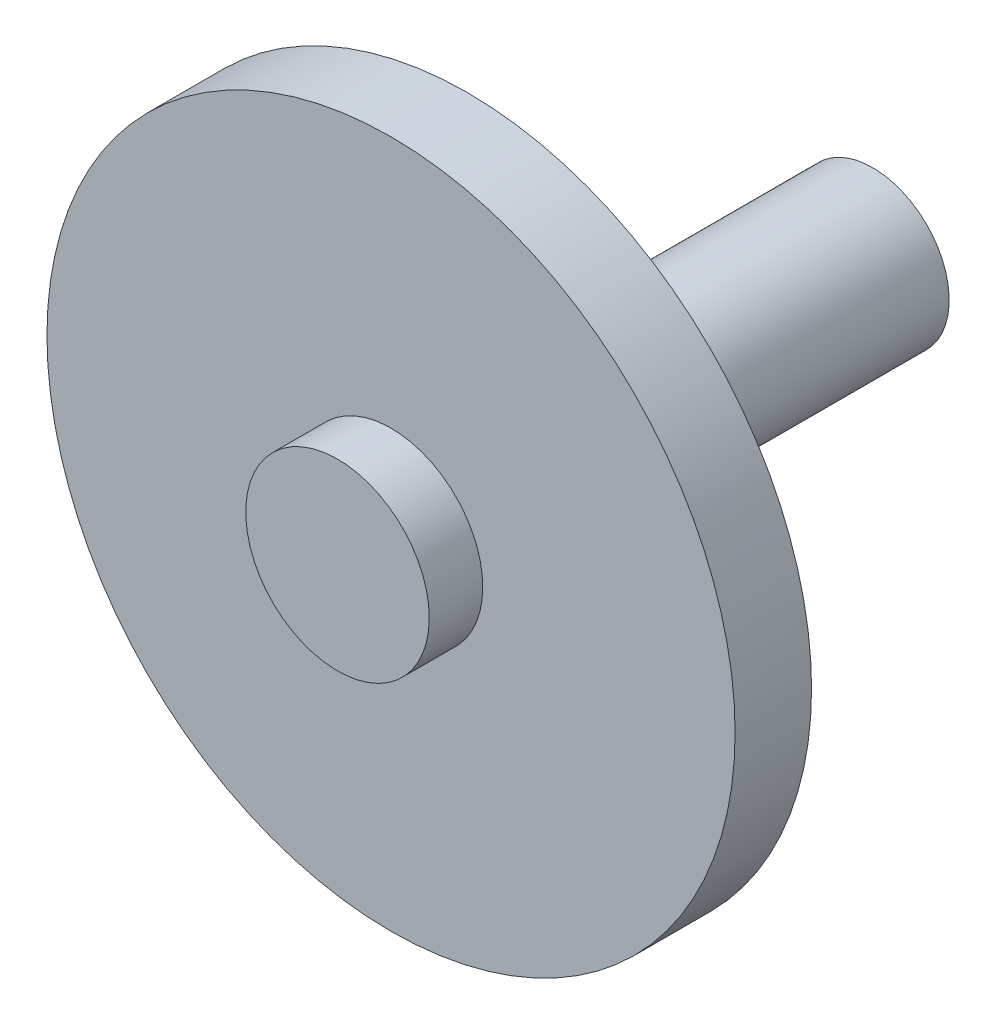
from build123d import *

# Parameters (mm, degrees)
SKETCH1_R           = 22.5
BOSS_EXTRUDE1_DEPTH = 5
SKETCH2_R           = 6
BOSS_EXTRUDE2_DEPTH = 3.5
SKETCH3_R           = 7.5
BOSS_EXTRUDE3_DEPTH = 2
SKETCH4_R           = 5.5
BOSS_EXTRUDE4_DEPTH = 6
SKETCH5_R           = 5
BOSS_EXTRUDE5_DEPTH = 18.5


with BuildPart() as part:
    # Sketch1 → Boss-Extrude1 (new body)
    with BuildSketch(Plane.XY):
        Circle(SKETCH1_R)
    extrude(amount=BOSS_EXTRUDE1_DEPTH)

    # Sketch2 → Boss-Extrude2 (add)
    with BuildSketch(Plane.XY.offset(5)):
        Circle(SKETCH2_R)
    extrude(amount=BOSS_EXTRUDE2_DEPTH)

    # Sketch3 → Boss-Extrude3 (add)
    with BuildSketch(Plane(origin=(0, 0, 0), x_dir=(-1, 0, 0), z_dir=(0, 0, -1))):
        with Locations(Location((0, 0, 0), (0, 0, 180))):
            Circle(SKETCH3_R)
    extrude(amount=BOSS_EXTRUDE3_DEPTH)

    # Sketch4 → Boss-Extrude4 (add)
    with BuildSketch(Plane(origin=(0, 0, -2), x_dir=(-1, 0, 0), z_dir=(0, 0, -1))):
        Circle(SKETCH4_R)
    extrude(amount=BOSS_EXTRUDE4_DEPTH)

    # Sketch5 → Boss-Extrude5 (add)
    with BuildSketch(Plane(origin=(0, 0, -8), x_dir=(-1, 0, 0), z_dir=(0, 0, -1))):
        Circle(SKETCH5_R)
    extrude(amount=BOSS_EXTRUDE5_DEPTH)


solid = part.part
